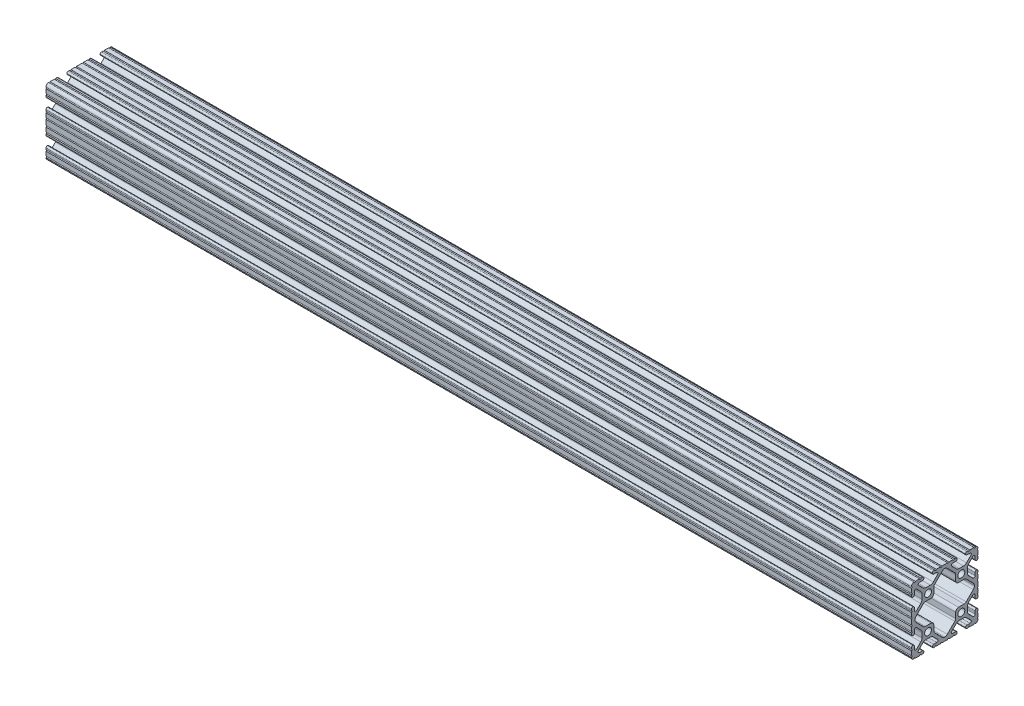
from build123d import *

# Parameters (mm, degrees)
SKETCH1_R      = 2.6035
EXTRUDE1_DEPTH = 330.2


with BuildPart() as part:
    # Sketch1 → Extrude1 (new, symmetric)
    with BuildSketch(Plane(origin=(0, 0, 0), x_dir=(0, 0, -1), z_dir=(1, 0, 0))):
        with BuildLine():
            Line((7.457926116, -25.399784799), (8.405129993, -25.399784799))
            ThreePointArc((8.405129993, -25.399784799), (9.151169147, -25.100147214), (9.461499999, -24.358492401))
            Line((9.461499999, -24.358492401), (9.461499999, -24.231492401))
            ThreePointArc((9.461499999, -24.231492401), (9.151169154, -23.489837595), (8.405130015, -23.190200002))
            Line((8.405130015, -23.190200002), (6.087754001, -23.190200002))
            ThreePointArc((6.087754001, -23.190200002), (5.173448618, -22.579280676), (5.387974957, -21.500783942))
            Line((5.387974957, -21.500783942), (8.763022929, -18.12573597))
            ThreePointArc((8.763022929, -18.12573597), (9.793067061, -17.437482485), (11.008086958, -17.195800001))
            Line((11.008086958, -17.195800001), (14.391913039, -17.195800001))
            ThreePointArc((14.391913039, -17.195800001), (15.606932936, -17.437482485), (16.636977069, -18.12573597))
            Line((16.636977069, -18.12573597), (20.01202504, -21.500783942))
            ThreePointArc((20.01202504, -21.500783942), (20.223734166, -22.586011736), (19.297652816, -23.190092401))
            Line((19.297652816, -23.190092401), (16.979899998, -23.190092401))
            ThreePointArc((16.979899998, -23.190092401), (16.243518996, -23.495111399), (15.938499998, -24.231492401))
            Line((15.938499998, -24.231492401), (15.938499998, -24.358492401))
            ThreePointArc((15.938499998, -24.358492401), (16.248830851, -25.100147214), (16.994870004, -25.399784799))
            Line((16.994870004, -25.399784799), (18.13401566, -25.399784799))
            ThreePointArc((18.13401566, -25.399784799), (18.636212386, -24.81521817), (19.138409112, -25.399784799))
            Line((19.138409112, -25.399784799), (22.413213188, -25.399784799))
            ThreePointArc((22.413213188, -25.399784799), (22.915409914, -24.815218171), (23.41760664, -25.399784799))
            Line((23.41760664, -25.399784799), (23.450078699, -25.399784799))
            ThreePointArc((23.450078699, -25.399784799), (24.83746982, -24.731205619), (25.399999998, -23.297534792))
            Line((25.399999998, -23.297534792), (25.399999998, -23.268649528))
            ThreePointArc((25.399999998, -23.268649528), (24.891999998, -22.760649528), (25.399999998, -22.252649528))
            Line((25.399999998, -22.252649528), (25.399999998, -19.025239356))
            ThreePointArc((25.399999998, -19.025239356), (24.891999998, -18.517239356), (25.399999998, -18.009239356))
            Line((25.399999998, -18.009239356), (25.399999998, -16.916041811))
            ThreePointArc((25.399999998, -16.916041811), (25.094981, -16.179660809), (24.358599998, -15.874641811))
            Line((24.358599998, -15.874641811), (24.231599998, -15.874641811))
            ThreePointArc((24.231599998, -15.874641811), (23.495218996, -16.179660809), (23.190199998, -16.916041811))
            Line((23.190199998, -16.916041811), (23.190199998, -19.10098879))
            ThreePointArc((23.190199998, -19.10098879), (22.563006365, -20.039650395), (21.455779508, -19.81940928))
            Line((21.455779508, -19.81940928), (18.278135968, -16.641765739))
            ThreePointArc((18.278135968, -16.641765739), (17.589882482, -15.611721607), (17.348199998, -14.396701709))
            Line((17.348199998, -14.396701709), (17.348199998, -11.003495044))
            ThreePointArc((17.348199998, -11.003495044), (17.59061076, -9.786718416), (18.280826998, -8.755743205))
            Line((18.280826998, -8.755743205), (21.456640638, -5.587529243))
            ThreePointArc((21.456640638, -5.587529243), (22.563568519, -5.368381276), (23.190199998, -6.306809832))
            Line((23.190199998, -6.306809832), (23.190199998, -8.483958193))
            ThreePointArc((23.190199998, -8.483958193), (23.495218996, -9.220339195), (24.231599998, -9.525358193))
            Line((24.231599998, -9.525358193), (24.358599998, -9.525358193))
            ThreePointArc((24.358599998, -9.525358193), (25.094981, -9.220339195), (25.399999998, -8.483958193))
            Line((25.399999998, -8.483958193), (25.399999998, -7.327686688))
            ThreePointArc((25.399999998, -7.327686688), (24.891999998, -6.819686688), (25.399999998, -6.311686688))
            Line((25.399999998, -6.311686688), (25.399999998, -3.084276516))
            ThreePointArc((25.399999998, -3.084276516), (24.891999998, -2.576276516), (25.399999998, -2.068276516))
            Line((25.399999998, -2.068276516), (25.399999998, 2.068276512))
            ThreePointArc((25.399999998, 2.068276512), (24.891999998, 2.576276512), (25.399999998, 3.084276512))
            Line((25.399999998, 3.084276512), (25.399999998, 6.311686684))
            ThreePointArc((25.399999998, 6.311686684), (24.891999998, 6.819686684), (25.399999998, 7.327686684))
            Line((25.399999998, 7.327686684), (25.399999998, 8.483958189))
            ThreePointArc((25.399999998, 8.483958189), (25.094981, 9.220339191), (24.358599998, 9.525358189))
            Line((24.358599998, 9.525358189), (24.231599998, 9.525358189))
            ThreePointArc((24.231599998, 9.525358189), (23.495218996, 9.220339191), (23.190199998, 8.483958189))
            Line((23.190199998, 8.483958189), (23.190199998, 6.306809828))
            ThreePointArc((23.190199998, 6.306809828), (22.563568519, 5.368381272), (21.456640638, 5.58752924))
            Line((21.456640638, 5.58752924), (18.280826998, 8.755743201))
            ThreePointArc((18.280826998, 8.755743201), (17.59061076, 9.786718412), (17.348199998, 11.00349504))
            Line((17.348199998, 11.00349504), (17.348199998, 14.396701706))
            ThreePointArc((17.348199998, 14.396701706), (17.589882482, 15.611721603), (18.278135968, 16.641765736))
            Line((18.278135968, 16.641765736), (21.455779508, 19.819409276))
            ThreePointArc((21.455779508, 19.819409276), (22.563006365, 20.039650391), (23.190199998, 19.100988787))
            Line((23.190199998, 19.100988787), (23.190199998, 16.916041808))
            ThreePointArc((23.190199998, 16.916041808), (23.495218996, 16.179660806), (24.231599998, 15.874641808))
            Line((24.231599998, 15.874641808), (24.358599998, 15.874641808))
            ThreePointArc((24.358599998, 15.874641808), (25.094981, 16.179660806), (25.399999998, 16.916041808))
            Line((25.399999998, 16.916041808), (25.399999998, 18.009239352))
            ThreePointArc((25.399999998, 18.009239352), (24.891999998, 18.517239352), (25.399999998, 19.025239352))
            Line((25.399999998, 19.025239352), (25.399999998, 22.252649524))
            ThreePointArc((25.399999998, 22.252649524), (24.891999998, 22.760649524), (25.399999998, 23.268649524))
            Line((25.399999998, 23.268649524), (25.399999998, 23.297534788))
            ThreePointArc((25.399999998, 23.297534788), (24.837469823, 24.731205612), (23.450078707, 25.399784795))
            Line((23.450078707, 25.399784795), (23.417606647, 25.399784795))
            ThreePointArc((23.417606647, 25.399784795), (22.915409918, 24.81521819), (22.413213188, 25.399784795))
            Line((22.413213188, 25.399784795), (19.138409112, 25.399784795))
            ThreePointArc((19.138409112, 25.399784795), (18.636212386, 24.815218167), (18.13401566, 25.399784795))
            Line((18.13401566, 25.399784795), (16.994870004, 25.399784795))
            ThreePointArc((16.994870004, 25.399784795), (16.248830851, 25.100147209), (15.938499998, 24.358492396))
            Line((15.938499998, 24.358492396), (15.938499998, 24.231492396))
            ThreePointArc((15.938499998, 24.231492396), (16.243518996, 23.495111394), (16.979899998, 23.190092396))
            Line((16.979899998, 23.190092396), (19.297652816, 23.190092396))
            ThreePointArc((19.297652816, 23.190092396), (20.223734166, 22.586011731), (20.01202504, 21.500783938))
            Line((20.01202504, 21.500783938), (16.636977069, 18.125735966))
            ThreePointArc((16.636977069, 18.125735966), (15.606932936, 17.437482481), (14.391913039, 17.195799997))
            Line((14.391913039, 17.195799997), (11.008086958, 17.195799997))
            ThreePointArc((11.008086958, 17.195799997), (9.793067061, 17.437482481), (8.763022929, 18.125735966))
            Line((8.763022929, 18.125735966), (5.387974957, 21.500783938))
            ThreePointArc((5.387974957, 21.500783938), (5.173448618, 22.579280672), (6.087754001, 23.190199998))
            Line((6.087754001, 23.190199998), (8.405130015, 23.190199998))
            ThreePointArc((8.405130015, 23.190199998), (9.151169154, 23.48983759), (9.461499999, 24.231492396))
            Line((9.461499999, 24.231492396), (9.461499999, 24.358492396))
            ThreePointArc((9.461499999, 24.358492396), (9.151169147, 25.10014721), (8.405129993, 25.399784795))
            Line((8.405129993, 25.399784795), (7.457926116, 25.399784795))
            ThreePointArc((7.457926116, 25.399784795), (6.95572939, 24.815218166), (6.453532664, 25.399784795))
            Line((6.453532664, 25.399784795), (3.214515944, 25.399784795))
            ThreePointArc((3.214515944, 25.399784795), (2.712319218, 24.815218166), (2.210122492, 25.399784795))
            Line((2.210122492, 25.399784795), (-2.210122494, 25.399784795))
            ThreePointArc((-2.210122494, 25.399784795), (-2.71231922, 24.815218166), (-3.214515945, 25.399784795))
            Line((-3.214515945, 25.399784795), (-6.453532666, 25.399784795))
            ThreePointArc((-6.453532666, 25.399784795), (-6.955729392, 24.815218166), (-7.457926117, 25.399784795))
            Line((-7.457926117, 25.399784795), (-8.405129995, 25.399784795))
            ThreePointArc((-8.405129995, 25.399784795), (-9.151169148, 25.10014721), (-9.461500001, 24.358492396))
            Line((-9.461500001, 24.358492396), (-9.461500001, 24.231492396))
            ThreePointArc((-9.461500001, 24.231492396), (-9.151169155, 23.48983759), (-8.405130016, 23.190199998))
            Line((-8.405130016, 23.190199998), (-6.087754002, 23.190199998))
            ThreePointArc((-6.087754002, 23.190199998), (-5.173448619, 22.579280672), (-5.387974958, 21.500783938))
            Line((-5.387974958, 21.500783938), (-8.76302293, 18.125735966))
            ThreePointArc((-8.76302293, 18.125735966), (-9.793067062, 17.437482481), (-11.00808696, 17.195799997))
            Line((-11.00808696, 17.195799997), (-14.39191304, 17.195799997))
            ThreePointArc((-14.39191304, 17.195799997), (-15.606932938, 17.437482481), (-16.63697707, 18.125735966))
            Line((-16.63697707, 18.125735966), (-20.012025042, 21.500783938))
            ThreePointArc((-20.012025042, 21.500783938), (-20.223734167, 22.586011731), (-19.297652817, 23.190092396))
            Line((-19.297652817, 23.190092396), (-16.979899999, 23.190092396))
            ThreePointArc((-16.979899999, 23.190092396), (-16.243518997, 23.495111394), (-15.938499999, 24.231492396))
            Line((-15.938499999, 24.231492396), (-15.938499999, 24.358492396))
            ThreePointArc((-15.938499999, 24.358492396), (-16.248830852, 25.100147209), (-16.994870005, 25.399784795))
            Line((-16.994870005, 25.399784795), (-18.134015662, 25.399784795))
            ThreePointArc((-18.134015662, 25.399784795), (-18.636212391, 24.815218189), (-19.13840912, 25.399784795))
            Line((-19.13840912, 25.399784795), (-22.413213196, 25.399784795))
            ThreePointArc((-22.413213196, 25.399784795), (-22.915409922, 24.815218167), (-23.417606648, 25.399784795))
            Line((-23.417606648, 25.399784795), (-23.450078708, 25.399784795))
            ThreePointArc((-23.450078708, 25.399784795), (-24.837469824, 24.731205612), (-25.399999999, 23.297534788))
            Line((-25.399999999, 23.297534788), (-25.399999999, 23.268649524))
            ThreePointArc((-25.399999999, 23.268649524), (-24.891999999, 22.760649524), (-25.399999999, 22.252649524))
            Line((-25.399999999, 22.252649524), (-25.399999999, 19.025239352))
            ThreePointArc((-25.399999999, 19.025239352), (-24.891999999, 18.517239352), (-25.399999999, 18.009239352))
            Line((-25.399999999, 18.009239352), (-25.399999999, 16.916041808))
            ThreePointArc((-25.399999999, 16.916041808), (-25.094981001, 16.179660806), (-24.358599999, 15.874641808))
            Line((-24.358599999, 15.874641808), (-24.231599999, 15.874641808))
            ThreePointArc((-24.231599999, 15.874641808), (-23.495218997, 16.179660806), (-23.190199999, 16.916041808))
            Line((-23.190199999, 16.916041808), (-23.190199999, 19.100988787))
            ThreePointArc((-23.190199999, 19.100988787), (-22.563006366, 20.039650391), (-21.45577951, 19.819409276))
            Line((-21.45577951, 19.819409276), (-18.278135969, 16.641765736))
            ThreePointArc((-18.278135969, 16.641765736), (-17.589882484, 15.611721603), (-17.348199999, 14.396701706))
            Line((-17.348199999, 14.396701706), (-17.348199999, 11.00349504))
            ThreePointArc((-17.348199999, 11.00349504), (-17.590610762, 9.786718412), (-18.280826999, 8.755743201))
            Line((-18.280826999, 8.755743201), (-21.456640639, 5.58752924))
            ThreePointArc((-21.456640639, 5.58752924), (-22.56356852, 5.368381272), (-23.190199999, 6.306809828))
            Line((-23.190199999, 6.306809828), (-23.190199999, 8.483958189))
            ThreePointArc((-23.190199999, 8.483958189), (-23.495218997, 9.220339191), (-24.231599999, 9.525358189))
            Line((-24.231599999, 9.525358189), (-24.358599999, 9.525358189))
            ThreePointArc((-24.358599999, 9.525358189), (-25.094981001, 9.220339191), (-25.399999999, 8.483958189))
            Line((-25.399999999, 8.483958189), (-25.399999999, 7.327686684))
            ThreePointArc((-25.399999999, 7.327686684), (-24.891999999, 6.819686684), (-25.399999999, 6.311686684))
            Line((-25.399999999, 6.311686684), (-25.399999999, 3.084276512))
            ThreePointArc((-25.399999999, 3.084276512), (-24.891999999, 2.576276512), (-25.399999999, 2.068276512))
            Line((-25.399999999, 2.068276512), (-25.399999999, -2.068276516))
            ThreePointArc((-25.399999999, -2.068276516), (-24.891999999, -2.576276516), (-25.399999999, -3.084276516))
            Line((-25.399999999, -3.084276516), (-25.399999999, -6.311686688))
            ThreePointArc((-25.399999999, -6.311686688), (-24.891999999, -6.819686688), (-25.399999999, -7.327686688))
            Line((-25.399999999, -7.327686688), (-25.399999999, -8.483958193))
            ThreePointArc((-25.399999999, -8.483958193), (-25.094981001, -9.220339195), (-24.358599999, -9.525358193))
            Line((-24.358599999, -9.525358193), (-24.231599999, -9.525358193))
            ThreePointArc((-24.231599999, -9.525358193), (-23.495218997, -9.220339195), (-23.190199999, -8.483958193))
            Line((-23.190199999, -8.483958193), (-23.190199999, -6.306809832))
            ThreePointArc((-23.190199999, -6.306809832), (-22.56356852, -5.368381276), (-21.456640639, -5.587529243))
            Line((-21.456640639, -5.587529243), (-18.280826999, -8.755743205))
            ThreePointArc((-18.280826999, -8.755743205), (-17.590610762, -9.786718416), (-17.348199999, -11.003495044))
            Line((-17.348199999, -11.003495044), (-17.348199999, -14.396701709))
            ThreePointArc((-17.348199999, -14.396701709), (-17.589882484, -15.611721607), (-18.278135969, -16.641765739))
            Line((-18.278135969, -16.641765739), (-21.45577951, -19.81940928))
            ThreePointArc((-21.45577951, -19.81940928), (-22.563006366, -20.039650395), (-23.190199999, -19.10098879))
            Line((-23.190199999, -19.10098879), (-23.190199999, -16.916041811))
            ThreePointArc((-23.190199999, -16.916041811), (-23.495218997, -16.179660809), (-24.231599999, -15.874641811))
            Line((-24.231599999, -15.874641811), (-24.358599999, -15.874641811))
            ThreePointArc((-24.358599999, -15.874641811), (-25.094981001, -16.179660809), (-25.399999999, -16.916041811))
            Line((-25.399999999, -16.916041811), (-25.399999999, -18.009239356))
            ThreePointArc((-25.399999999, -18.009239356), (-24.891999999, -18.517239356), (-25.399999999, -19.025239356))
            Line((-25.399999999, -19.025239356), (-25.399999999, -22.252649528))
            ThreePointArc((-25.399999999, -22.252649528), (-24.891999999, -22.760649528), (-25.399999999, -23.268649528))
            Line((-25.399999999, -23.268649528), (-25.399999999, -23.297534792))
            ThreePointArc((-25.399999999, -23.297534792), (-24.837469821, -24.731205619), (-23.450078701, -25.399784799))
            Line((-23.450078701, -25.399784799), (-23.417606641, -25.399784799))
            ThreePointArc((-23.417606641, -25.399784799), (-22.915409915, -24.81521817), (-22.413213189, -25.399784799))
            Line((-22.413213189, -25.399784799), (-19.138409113, -25.399784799))
            ThreePointArc((-19.138409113, -25.399784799), (-18.636212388, -24.81521817), (-18.134015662, -25.399784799))
            Line((-18.134015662, -25.399784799), (-16.994870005, -25.399784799))
            ThreePointArc((-16.994870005, -25.399784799), (-16.248830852, -25.100147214), (-15.938499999, -24.358492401))
            Line((-15.938499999, -24.358492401), (-15.938499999, -24.231492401))
            ThreePointArc((-15.938499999, -24.231492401), (-16.243518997, -23.495111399), (-16.979899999, -23.190092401))
            Line((-16.979899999, -23.190092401), (-19.297652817, -23.190092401))
            ThreePointArc((-19.297652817, -23.190092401), (-20.223734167, -22.586011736), (-20.012025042, -21.500783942))
            Line((-20.012025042, -21.500783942), (-16.63697707, -18.12573597))
            ThreePointArc((-16.63697707, -18.12573597), (-15.606932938, -17.437482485), (-14.39191304, -17.195800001))
            Line((-14.39191304, -17.195800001), (-11.00808696, -17.195800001))
            ThreePointArc((-11.00808696, -17.195800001), (-9.793067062, -17.437482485), (-8.76302293, -18.12573597))
            Line((-8.76302293, -18.12573597), (-5.387974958, -21.500783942))
            ThreePointArc((-5.387974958, -21.500783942), (-5.173448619, -22.579280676), (-6.087754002, -23.190200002))
            Line((-6.087754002, -23.190200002), (-8.405130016, -23.190200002))
            ThreePointArc((-8.405130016, -23.190200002), (-9.151169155, -23.489837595), (-9.461500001, -24.231492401))
            Line((-9.461500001, -24.231492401), (-9.461500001, -24.358492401))
            ThreePointArc((-9.461500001, -24.358492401), (-9.151169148, -25.100147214), (-8.405129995, -25.399784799))
            Line((-8.405129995, -25.399784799), (-7.457926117, -25.399784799))
            ThreePointArc((-7.457926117, -25.399784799), (-6.955729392, -24.81521817), (-6.453532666, -25.399784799))
            Line((-6.453532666, -25.399784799), (-3.214515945, -25.399784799))
            ThreePointArc((-3.214515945, -25.399784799), (-2.71231922, -24.81521817), (-2.210122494, -25.399784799))
            Line((-2.210122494, -25.399784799), (2.210122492, -25.399784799))
            ThreePointArc((2.210122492, -25.399784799), (2.712319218, -24.81521817), (3.214515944, -25.399784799))
            Line((3.214515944, -25.399784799), (6.453532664, -25.399784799))
            ThreePointArc((6.453532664, -25.399784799), (6.95572939, -24.815218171), (7.457926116, -25.399784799))
        make_face()
        with Locations((12.7, 12.7)):
            Circle(SKETCH1_R, mode=Mode.SUBTRACT)
        with Locations((-12.7, 12.7)):
            Circle(SKETCH1_R, mode=Mode.SUBTRACT)
        with Locations((-12.7, -12.7)):
            Circle(SKETCH1_R, mode=Mode.SUBTRACT)
        with Locations((12.7, -12.7)):
            Circle(SKETCH1_R, mode=Mode.SUBTRACT)
        with BuildLine():
            Line((-7.683964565, -16.079665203), (-1.987770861, -21.775858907))
            ThreePointArc((-1.987770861, -21.775858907), (-1.075921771, -22.393947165), (0, -22.630366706))
            ThreePointArc((0, -22.630366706), (1.07592177, -22.393947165), (1.98777086, -21.775858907))
            Line((1.98777086, -21.775858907), (7.683964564, -16.079665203))
            ThreePointArc((7.683964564, -16.079665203), (8.16298899, -15.362754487), (8.331199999, -14.517100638))
            Line((8.331199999, -14.517100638), (8.331199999, -10.3886))
            ThreePointArc((8.331199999, -10.3886), (8.978435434, -8.826035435), (10.540999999, -8.1788))
            Line((10.540999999, -8.1788), (14.816495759, -8.1788))
            ThreePointArc((14.816495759, -8.1788), (15.66092662, -8.01109514), (16.377187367, -7.53343528))
            Line((16.377187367, -7.53343528), (21.773383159, -2.150152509))
            ThreePointArc((21.773383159, -2.150152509), (22.408382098, -1.201655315), (22.631399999, -0.082220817))
            Line((22.631399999, -0.082220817), (22.631399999, 0.082220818))
            ThreePointArc((22.631399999, 0.082220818), (22.408382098, 1.201655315), (21.773383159, 2.150152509))
            Line((21.773383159, 2.150152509), (16.376754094, 7.533867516))
            ThreePointArc((16.376754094, 7.533867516), (15.660493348, 8.011527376), (14.816062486, 8.179232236))
            Line((14.816062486, 8.179232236), (10.540999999, 8.179232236))
            ThreePointArc((10.540999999, 8.179232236), (8.978435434, 8.826467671), (8.331199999, 10.389032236))
            Line((8.331199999, 10.389032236), (8.331199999, 14.517100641))
            ThreePointArc((8.331199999, 14.517100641), (8.16298899, 15.362754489), (7.683964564, 16.079665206))
            Line((7.683964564, 16.079665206), (1.795557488, 21.968072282))
            ThreePointArc((1.795557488, 21.968072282), (0.971532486, 22.546678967), (1.3e-08, 22.811117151))
            ThreePointArc((1.3e-08, 22.811117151), (-0.971532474, 22.54667897), (-1.795557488, 21.96807228))
            Line((-1.795557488, 21.96807228), (-7.683964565, 16.079665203))
            ThreePointArc((-7.683964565, 16.079665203), (-8.162988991, 15.362754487), (-8.3312, 14.517100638))
            Line((-8.3312, 14.517100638), (-8.3312, 10.3886))
            ThreePointArc((-8.3312, 10.3886), (-8.978435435, 8.826035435), (-10.541, 8.1788))
            Line((-10.541, 8.1788), (-14.816495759, 8.1788))
            ThreePointArc((-14.816495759, 8.1788), (-15.660926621, 8.01109514), (-16.377187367, 7.53343528))
            Line((-16.377187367, 7.53343528), (-21.77338316, 2.150152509))
            ThreePointArc((-21.77338316, 2.150152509), (-22.408382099, 1.201655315), (-22.6314, 0.082220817))
            Line((-22.6314, 0.082220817), (-22.6314, -0.082220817))
            ThreePointArc((-22.6314, -0.082220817), (-22.408382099, -1.201655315), (-21.77338316, -2.150152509))
            Line((-21.77338316, -2.150152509), (-16.377187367, -7.53343528))
            ThreePointArc((-16.377187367, -7.53343528), (-15.660926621, -8.01109514), (-14.816495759, -8.1788))
            Line((-14.816495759, -8.1788), (-10.541, -8.1788))
            ThreePointArc((-10.541, -8.1788), (-8.978435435, -8.826035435), (-8.3312, -10.3886))
            Line((-8.3312, -10.3886), (-8.3312, -14.517100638))
            ThreePointArc((-8.3312, -14.517100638), (-8.162988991, -15.362754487), (-7.683964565, -16.079665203))
        make_face(mode=Mode.SUBTRACT)
    extrude(amount=EXTRUDE1_DEPTH, both=True)


solid = part.part
